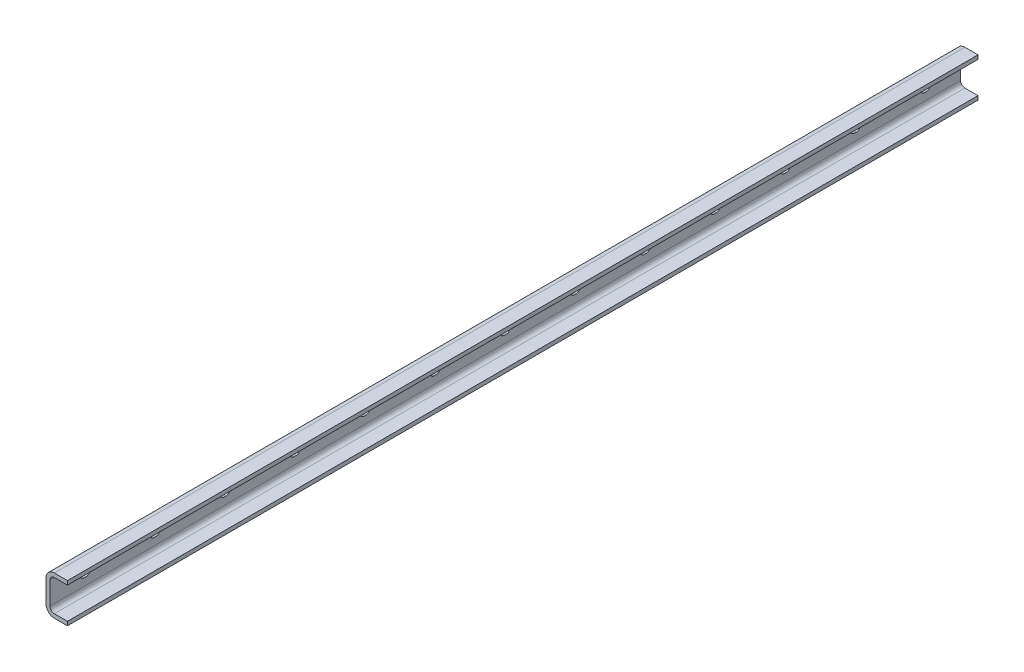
from build123d import *

# Parameters (mm, degrees)
EXTRUDE1_DEPTH  = 1040
EXTRUDE2_DEPTH  = 1041.433448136
LPATTERN1_COUNT = 13
LPATTERN1_PITCH = 80


with BuildPart() as part:
    # Sketch1 → Extrude1 (new body)
    with BuildSketch(Plane.XY):
        with BuildLine():
            Line((24.5, 17.9), (24.5, 22.4))
            Line((24.5, 22.4), (9.5, 22.4))
            ThreePointArc((9.5, 22.4), (2.782485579, 19.617514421), (0, 12.9))
            Line((0, 12.9), (0, -12.9))
            ThreePointArc((0, -12.9), (2.782485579, -19.617514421), (9.5, -22.4))
            Line((9.5, -22.4), (24.5, -22.4))
            Line((24.5, -22.4), (24.5, -17.9))
            Line((24.5, -17.9), (9.5, -17.9))
            ThreePointArc((9.5, -17.9), (5.964466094, -16.435533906), (4.5, -12.9))
            Line((4.5, -12.9), (4.5, 12.9))
            ThreePointArc((4.5, 12.9), (5.964466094, 16.435533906), (9.5, 17.9))
            Line((9.5, 17.9), (24.5, 17.9))
        make_face()
    extrude(amount=-EXTRUDE1_DEPTH)

    # Sketch2 → Extrude2 (cut, through all)
    with BuildSketch(Plane(origin=(4.5, 0, 0), x_dir=(0, 0, -1), z_dir=(1, 0, 0))):
        with BuildLine():
            Line((39, 4.5), (41, 4.5))
            ThreePointArc((41, 4.5), (45.5, 0), (41, -4.5))
            Line((41, -4.5), (39, -4.5))
            ThreePointArc((39, -4.5), (34.5, 0), (39, 4.5))
        make_face()
    extrude2 = extrude(amount=-EXTRUDE2_DEPTH, mode=Mode.SUBTRACT)

    # LPattern1: Extrude2 ×13
    with Locations(*[(0, 0, -i * LPATTERN1_PITCH) for i in range(1, LPATTERN1_COUNT)]):
        add(extrude2, mode=Mode.SUBTRACT)


solid = part.part
